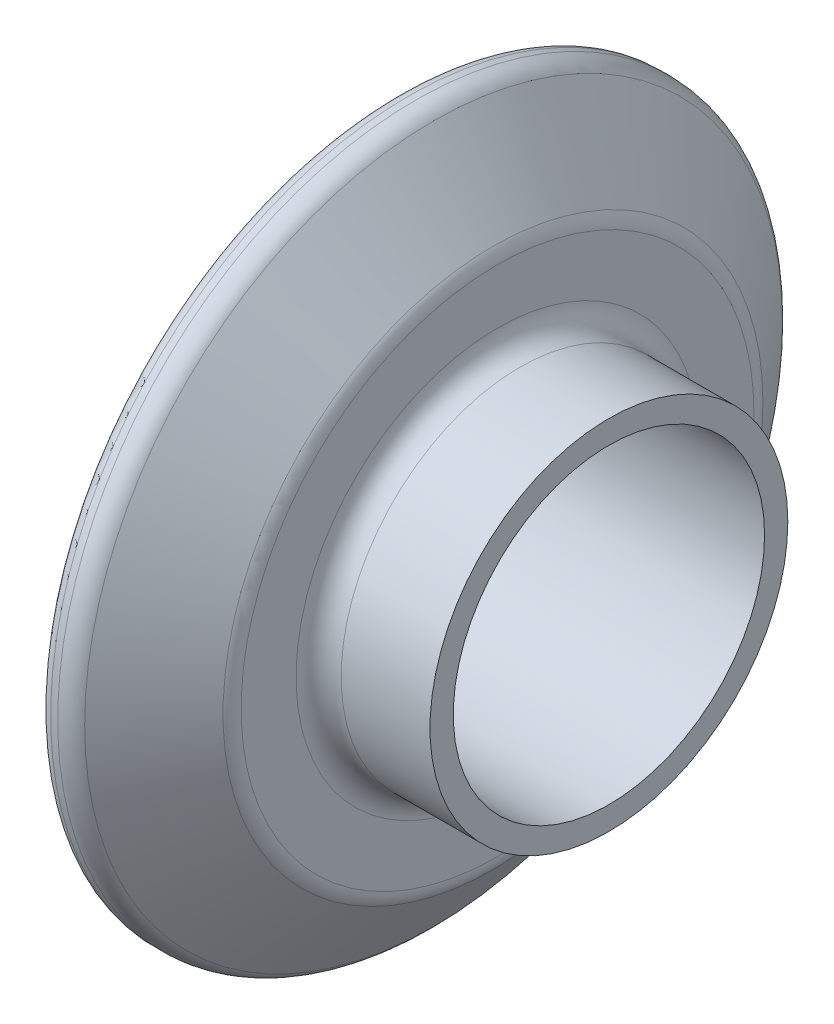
from build123d import *


with BuildPart() as part:
    # Sketch1 → Revolve1 (revolve)
    with BuildSketch(Plane.XY, mode=Mode.PRIVATE) as revolve1_sk:
        with BuildLine():
            Line((-3.261783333, 11.049), (-23.251583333, 11.049))
            Line((-23.251583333, 11.049), (-23.251583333, 14.9098))
            ThreePointArc((-23.251583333, 14.9098), (-23.013519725, 15.484536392), (-22.438783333, 15.7226))
            Line((-22.438783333, 15.7226), (-19.111383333, 15.7226))
            ThreePointArc((-19.111383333, 15.7226), (-18.536646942, 15.960663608), (-18.298583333, 16.5354))
            Line((-18.298583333, 16.5354), (-18.298583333, 24.5872))
            ThreePointArc((-18.298583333, 24.5872), (-18.060519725, 25.161936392), (-17.485783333, 25.4))
            Line((-17.485783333, 25.4), (-16.988213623, 25.4))
            ThreePointArc((-16.988213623, 25.4), (-16.274207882, 25.231873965), (-15.710237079, 24.7628244))
            Line((-15.710237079, 24.7628244), (-11.490478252, 19.1630153))
            ThreePointArc((-11.490478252, 19.1630153), (-11.250947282, 18.707741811), (-11.168254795, 18.199990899))
            Line((-11.168254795, 18.199990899), (-11.168254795, 14.3002))
            ThreePointArc((-11.168254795, 14.3002), (-10.699567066, 13.168687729), (-9.568054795, 12.7))
            Line((-9.568054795, 12.7), (-3.261783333, 12.7))
            Line((-3.261783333, 12.7), (-3.261783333, 11.049))
        make_face()
    revolve(revolve1_sk.sketch.rotate(Axis((0, 0, 0), (-1, 0, 0)), 90), axis=Axis((0, 0, 0), (-1, 0, 0)))


solid = part.part
